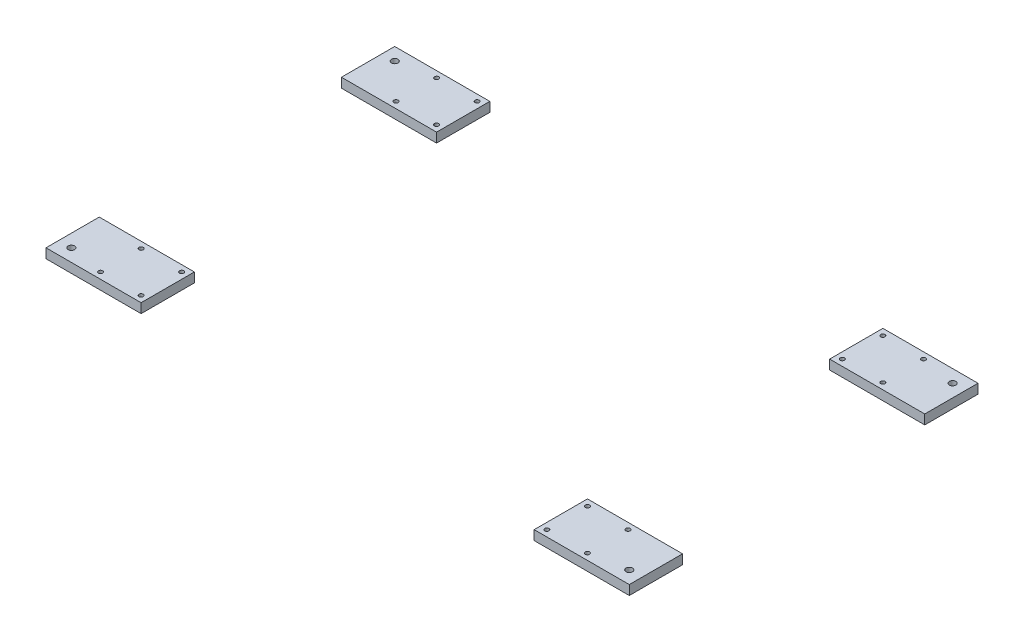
ISO-10303-21;
HEADER;
FILE_DESCRIPTION(('STEP AP214'),'2;1');
FILE_NAME('part.step','',(''),(''),'','','');
FILE_SCHEMA(('AUTOMOTIVE_DESIGN { 1 0 10303 214 1 1 1 1 }'));
ENDSEC;
DATA;
#1=APPLICATION_CONTEXT('core data for automotive mechanical design processes');
#2=APPLICATION_PROTOCOL_DEFINITION('international standard','automotive_design',2000,#1);
#3=PRODUCT_CONTEXT('',#1,'mechanical');
#4=PRODUCT('Part','Part','',(#3));
#5=PRODUCT_RELATED_PRODUCT_CATEGORY('part','',(#4));
#6=PRODUCT_DEFINITION_FORMATION('','',#4);
#7=PRODUCT_DEFINITION_CONTEXT('part definition',#1,'design');
#8=PRODUCT_DEFINITION('design','',#6,#7);
#9=PRODUCT_DEFINITION_SHAPE('','',#8);
#10=(LENGTH_UNIT() NAMED_UNIT(*) SI_UNIT(.MILLI.,.METRE.));
#11=(NAMED_UNIT(*) PLANE_ANGLE_UNIT() SI_UNIT($,.RADIAN.));
#12=(NAMED_UNIT(*) SI_UNIT($,.STERADIAN.) SOLID_ANGLE_UNIT());
#13=UNCERTAINTY_MEASURE_WITH_UNIT(LENGTH_MEASURE(1.E-05),#10,'distance_accuracy_value','');
#14=(GEOMETRIC_REPRESENTATION_CONTEXT(3) GLOBAL_UNCERTAINTY_ASSIGNED_CONTEXT((#13)) GLOBAL_UNIT_ASSIGNED_CONTEXT((#10,
#11,#12)) REPRESENTATION_CONTEXT('',''));
#15=CARTESIAN_POINT('',(0.,0.,0.));
#16=DIRECTION('',(0.,0.,1.));
#17=DIRECTION('',(1.,0.,0.));
#18=AXIS2_PLACEMENT_3D('',#15,#16,#17);
#19=CARTESIAN_POINT('',(770.,0.,550.));
#20=DIRECTION('',(1.,0.,0.));
#21=DIRECTION('',(0.,0.,-1.));
#22=AXIS2_PLACEMENT_3D('',#19,#20,#21);
#23=PLANE('',#22);
#24=DIRECTION('',(0.,1.,0.));
#25=VECTOR('',#24,1.);
#26=CARTESIAN_POINT('',(770.,-535.,466.));
#27=LINE('',#26,#25);
#28=CARTESIAN_POINT('',(770.,0.,466.));
#29=VERTEX_POINT('',#28);
#30=CARTESIAN_POINT('',(770.,15.,466.));
#31=VERTEX_POINT('',#30);
#32=EDGE_CURVE('E80',#29,#31,#27,.T.);
#33=ORIENTED_EDGE('',*,*,#32,.F.);
#34=DIRECTION('',(0.,0.,-1.));
#35=VECTOR('',#34,1.);
#36=CARTESIAN_POINT('',(770.,0.,550.));
#37=LINE('',#36,#35);
#38=CARTESIAN_POINT('',(770.,0.,550.));
#39=VERTEX_POINT('',#38);
#40=EDGE_CURVE('E123',#39,#29,#37,.T.);
#41=ORIENTED_EDGE('',*,*,#40,.F.);
#42=DIRECTION('',(0.,-1.,0.));
#43=VECTOR('',#42,1.);
#44=CARTESIAN_POINT('',(770.,0.,550.));
#45=LINE('',#44,#43);
#46=CARTESIAN_POINT('',(770.,15.,550.));
#47=VERTEX_POINT('',#46);
#48=EDGE_CURVE('E102',#47,#39,#45,.T.);
#49=ORIENTED_EDGE('',*,*,#48,.F.);
#50=DIRECTION('',(0.,0.,-1.));
#51=VECTOR('',#50,1.);
#52=CARTESIAN_POINT('',(770.,15.,550.));
#53=LINE('',#52,#51);
#54=EDGE_CURVE('E47',#47,#31,#53,.T.);
#55=ORIENTED_EDGE('',*,*,#54,.T.);
#56=EDGE_LOOP('',(#33,#41,#49,#55));
#57=FACE_BOUND('',#56,.T.);
#58=ADVANCED_FACE('F44',(#57),#23,.F.);
#59=CARTESIAN_POINT('',(770.,0.,550.));
#60=DIRECTION('',(0.,1.,0.));
#61=DIRECTION('',(0.,0.,1.));
#62=AXIS2_PLACEMENT_3D('',#59,#60,#61);
#63=PLANE('',#62);
#64=CARTESIAN_POINT('',(780.,0.,540.));
#65=DIRECTION('',(0.,1.,0.));
#66=DIRECTION('',(0.,0.,1.));
#67=AXIS2_PLACEMENT_3D('',#64,#65,#66);
#68=CIRCLE('',#67,3.37500000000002);
#69=CARTESIAN_POINT('',(780.,0.,543.375));
#70=VERTEX_POINT('',#69);
#71=EDGE_CURVE('E103',#70,#70,#68,.T.);
#72=ORIENTED_EDGE('',*,*,#71,.T.);
#73=EDGE_LOOP('',(#72));
#74=FACE_BOUND('',#73,.T.);
#75=CARTESIAN_POINT('',(780.,0.,476.));
#76=DIRECTION('',(0.,1.,0.));
#77=DIRECTION('',(0.,0.,1.));
#78=AXIS2_PLACEMENT_3D('',#75,#76,#77);
#79=CIRCLE('',#78,3.37500000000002);
#80=CARTESIAN_POINT('',(780.,0.,479.375000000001));
#81=VERTEX_POINT('',#80);
#82=EDGE_CURVE('E105',#81,#81,#79,.T.);
#83=ORIENTED_EDGE('',*,*,#82,.T.);
#84=EDGE_LOOP('',(#83));
#85=FACE_BOUND('',#84,.T.);
#86=CARTESIAN_POINT('',(843.999999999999,0.,476.));
#87=DIRECTION('',(0.,1.,0.));
#88=DIRECTION('',(0.,0.,1.));
#89=AXIS2_PLACEMENT_3D('',#86,#87,#88);
#90=CIRCLE('',#89,3.37500000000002);
#91=CARTESIAN_POINT('',(843.999999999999,0.,479.375000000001));
#92=VERTEX_POINT('',#91);
#93=EDGE_CURVE('E110',#92,#92,#90,.T.);
#94=ORIENTED_EDGE('',*,*,#93,.T.);
#95=EDGE_LOOP('',(#94));
#96=FACE_BOUND('',#95,.T.);
#97=CARTESIAN_POINT('',(843.999999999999,0.,540.));
#98=DIRECTION('',(0.,1.,0.));
#99=DIRECTION('',(0.,0.,1.));
#100=AXIS2_PLACEMENT_3D('',#97,#98,#99);
#101=CIRCLE('',#100,3.37500000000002);
#102=CARTESIAN_POINT('',(843.999999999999,0.,543.375));
#103=VERTEX_POINT('',#102);
#104=EDGE_CURVE('E117',#103,#103,#101,.T.);
#105=ORIENTED_EDGE('',*,*,#104,.T.);
#106=EDGE_LOOP('',(#105));
#107=FACE_BOUND('',#106,.T.);
#108=CARTESIAN_POINT('',(900.,0.,530.));
#109=DIRECTION('',(0.,1.,0.));
#110=DIRECTION('',(0.,0.,1.));
#111=AXIS2_PLACEMENT_3D('',#108,#109,#110);
#112=CIRCLE('',#111,5.12500000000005);
#113=CARTESIAN_POINT('',(900.,0.,535.125));
#114=VERTEX_POINT('',#113);
#115=EDGE_CURVE('E120',#114,#114,#112,.T.);
#116=ORIENTED_EDGE('',*,*,#115,.T.);
#117=EDGE_LOOP('',(#116));
#118=FACE_BOUND('',#117,.T.);
#119=DIRECTION('',(-1.,0.,0.));
#120=VECTOR('',#119,1.);
#121=CARTESIAN_POINT('',(770.,0.,466.));
#122=LINE('',#121,#120);
#123=CARTESIAN_POINT('',(919.999999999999,0.,466.));
#124=VERTEX_POINT('',#123);
#125=EDGE_CURVE('E84',#124,#29,#122,.T.);
#126=ORIENTED_EDGE('',*,*,#125,.F.);
#127=DIRECTION('',(0.,0.,-1.));
#128=VECTOR('',#127,1.);
#129=CARTESIAN_POINT('',(920.,0.,550.));
#130=LINE('',#129,#128);
#131=CARTESIAN_POINT('',(920.,0.,550.));
#132=VERTEX_POINT('',#131);
#133=EDGE_CURVE('E99',#132,#124,#130,.T.);
#134=ORIENTED_EDGE('',*,*,#133,.F.);
#135=DIRECTION('',(1.,0.,0.));
#136=VECTOR('',#135,1.);
#137=CARTESIAN_POINT('',(770.,0.,550.));
#138=LINE('',#137,#136);
#139=EDGE_CURVE('E139',#39,#132,#138,.T.);
#140=ORIENTED_EDGE('',*,*,#139,.F.);
#141=ORIENTED_EDGE('',*,*,#40,.T.);
#142=EDGE_LOOP('',(#126,#134,#140,#141));
#143=FACE_BOUND('',#142,.T.);
#144=ADVANCED_FACE('F150',(#74,#85,#96,#107,#118,#143),#63,.F.);
#145=CARTESIAN_POINT('',(920.,0.,550.));
#146=DIRECTION('',(-1.,0.,0.));
#147=DIRECTION('',(0.,0.,1.));
#148=AXIS2_PLACEMENT_3D('',#145,#146,#147);
#149=PLANE('',#148);
#150=DIRECTION('',(0.,1.,0.));
#151=VECTOR('',#150,1.);
#152=CARTESIAN_POINT('',(919.999999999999,-535.,466.));
#153=LINE('',#152,#151);
#154=CARTESIAN_POINT('',(919.999999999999,15.,466.));
#155=VERTEX_POINT('',#154);
#156=EDGE_CURVE('E60',#124,#155,#153,.T.);
#157=ORIENTED_EDGE('',*,*,#156,.T.);
#158=DIRECTION('',(0.,0.,-1.));
#159=VECTOR('',#158,1.);
#160=CARTESIAN_POINT('',(920.,15.,550.));
#161=LINE('',#160,#159);
#162=CARTESIAN_POINT('',(920.,15.,550.));
#163=VERTEX_POINT('',#162);
#164=EDGE_CURVE('E98',#163,#155,#161,.T.);
#165=ORIENTED_EDGE('',*,*,#164,.F.);
#166=DIRECTION('',(0.,1.,0.));
#167=VECTOR('',#166,1.);
#168=CARTESIAN_POINT('',(920.,0.,550.));
#169=LINE('',#168,#167);
#170=EDGE_CURVE('E141',#132,#163,#169,.T.);
#171=ORIENTED_EDGE('',*,*,#170,.F.);
#172=ORIENTED_EDGE('',*,*,#133,.T.);
#173=EDGE_LOOP('',(#157,#165,#171,#172));
#174=FACE_BOUND('',#173,.T.);
#175=ADVANCED_FACE('F148',(#174),#149,.F.);
#176=CARTESIAN_POINT('',(770.,15.,550.));
#177=DIRECTION('',(0.,-1.,0.));
#178=DIRECTION('',(0.,0.,-1.));
#179=AXIS2_PLACEMENT_3D('',#176,#177,#178);
#180=PLANE('',#179);
#181=CARTESIAN_POINT('',(780.,15.,540.));
#182=DIRECTION('',(0.,1.,0.));
#183=DIRECTION('',(0.,0.,1.));
#184=AXIS2_PLACEMENT_3D('',#181,#182,#183);
#185=CIRCLE('',#184,3.37500000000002);
#186=CARTESIAN_POINT('',(780.,15.,543.375));
#187=VERTEX_POINT('',#186);
#188=EDGE_CURVE('E13',#187,#187,#185,.T.);
#189=ORIENTED_EDGE('',*,*,#188,.F.);
#190=EDGE_LOOP('',(#189));
#191=FACE_BOUND('',#190,.T.);
#192=CARTESIAN_POINT('',(780.,15.,476.));
#193=DIRECTION('',(0.,1.,0.));
#194=DIRECTION('',(0.,0.,1.));
#195=AXIS2_PLACEMENT_3D('',#192,#193,#194);
#196=CIRCLE('',#195,3.37500000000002);
#197=CARTESIAN_POINT('',(780.,15.,479.375000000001));
#198=VERTEX_POINT('',#197);
#199=EDGE_CURVE('E53',#198,#198,#196,.T.);
#200=ORIENTED_EDGE('',*,*,#199,.F.);
#201=EDGE_LOOP('',(#200));
#202=FACE_BOUND('',#201,.T.);
#203=CARTESIAN_POINT('',(843.999999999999,15.,476.));
#204=DIRECTION('',(0.,1.,0.));
#205=DIRECTION('',(0.,0.,1.));
#206=AXIS2_PLACEMENT_3D('',#203,#204,#205);
#207=CIRCLE('',#206,3.37500000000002);
#208=CARTESIAN_POINT('',(843.999999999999,15.,479.375000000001));
#209=VERTEX_POINT('',#208);
#210=EDGE_CURVE('E132',#209,#209,#207,.T.);
#211=ORIENTED_EDGE('',*,*,#210,.F.);
#212=EDGE_LOOP('',(#211));
#213=FACE_BOUND('',#212,.T.);
#214=CARTESIAN_POINT('',(843.999999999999,15.,540.));
#215=DIRECTION('',(0.,1.,0.));
#216=DIRECTION('',(0.,0.,1.));
#217=AXIS2_PLACEMENT_3D('',#214,#215,#216);
#218=CIRCLE('',#217,3.37500000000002);
#219=CARTESIAN_POINT('',(843.999999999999,15.,543.375));
#220=VERTEX_POINT('',#219);
#221=EDGE_CURVE('E129',#220,#220,#218,.T.);
#222=ORIENTED_EDGE('',*,*,#221,.F.);
#223=EDGE_LOOP('',(#222));
#224=FACE_BOUND('',#223,.T.);
#225=CARTESIAN_POINT('',(900.,15.,530.));
#226=DIRECTION('',(0.,1.,0.));
#227=DIRECTION('',(0.,0.,1.));
#228=AXIS2_PLACEMENT_3D('',#225,#226,#227);
#229=CIRCLE('',#228,5.12500000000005);
#230=CARTESIAN_POINT('',(900.,15.,535.125));
#231=VERTEX_POINT('',#230);
#232=EDGE_CURVE('E89',#231,#231,#229,.T.);
#233=ORIENTED_EDGE('',*,*,#232,.F.);
#234=EDGE_LOOP('',(#233));
#235=FACE_BOUND('',#234,.T.);
#236=DIRECTION('',(-1.,0.,0.));
#237=VECTOR('',#236,1.);
#238=CARTESIAN_POINT('',(770.,15.,466.));
#239=LINE('',#238,#237);
#240=EDGE_CURVE('E83',#155,#31,#239,.T.);
#241=ORIENTED_EDGE('',*,*,#240,.T.);
#242=ORIENTED_EDGE('',*,*,#54,.F.);
#243=DIRECTION('',(-1.,0.,0.));
#244=VECTOR('',#243,1.);
#245=CARTESIAN_POINT('',(770.,15.,550.));
#246=LINE('',#245,#244);
#247=EDGE_CURVE('E125',#163,#47,#246,.T.);
#248=ORIENTED_EDGE('',*,*,#247,.F.);
#249=ORIENTED_EDGE('',*,*,#164,.T.);
#250=EDGE_LOOP('',(#241,#242,#248,#249));
#251=FACE_BOUND('',#250,.T.);
#252=ADVANCED_FACE('F94',(#191,#202,#213,#224,#235,#251),#180,.F.);
#253=CARTESIAN_POINT('',(770.,15.,550.));
#254=DIRECTION('',(0.,0.,-1.));
#255=DIRECTION('',(-1.,0.,0.));
#256=AXIS2_PLACEMENT_3D('',#253,#254,#255);
#257=PLANE('',#256);
#258=ORIENTED_EDGE('',*,*,#48,.T.);
#259=ORIENTED_EDGE('',*,*,#139,.T.);
#260=ORIENTED_EDGE('',*,*,#170,.T.);
#261=ORIENTED_EDGE('',*,*,#247,.T.);
#262=EDGE_LOOP('',(#258,#259,#260,#261));
#263=FACE_BOUND('',#262,.T.);
#264=ADVANCED_FACE('F145',(#263),#257,.F.);
#265=CARTESIAN_POINT('',(770.,-535.,466.));
#266=DIRECTION('',(0.,0.,-1.));
#267=DIRECTION('',(-1.,0.,0.));
#268=AXIS2_PLACEMENT_3D('',#265,#266,#267);
#269=PLANE('',#268);
#270=ORIENTED_EDGE('',*,*,#125,.T.);
#271=ORIENTED_EDGE('',*,*,#32,.T.);
#272=ORIENTED_EDGE('',*,*,#240,.F.);
#273=ORIENTED_EDGE('',*,*,#156,.F.);
#274=EDGE_LOOP('',(#270,#271,#272,#273));
#275=FACE_BOUND('',#274,.T.);
#276=ADVANCED_FACE('F82',(#275),#269,.T.);
#277=CARTESIAN_POINT('',(900.,-535.,530.));
#278=DIRECTION('',(0.,1.,0.));
#279=DIRECTION('',(0.,0.,1.));
#280=AXIS2_PLACEMENT_3D('',#277,#278,#279);
#281=CYLINDRICAL_SURFACE('',#280,5.12500000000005);
#282=ORIENTED_EDGE('',*,*,#232,.T.);
#283=EDGE_LOOP('',(#282));
#284=FACE_BOUND('',#283,.T.);
#285=ORIENTED_EDGE('',*,*,#115,.F.);
#286=EDGE_LOOP('',(#285));
#287=FACE_BOUND('',#286,.T.);
#288=ADVANCED_FACE('F177',(#284,#287),#281,.F.);
#289=CARTESIAN_POINT('',(843.999999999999,-535.,540.));
#290=DIRECTION('',(0.,1.,0.));
#291=DIRECTION('',(0.,0.,1.));
#292=AXIS2_PLACEMENT_3D('',#289,#290,#291);
#293=CYLINDRICAL_SURFACE('',#292,3.37500000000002);
#294=ORIENTED_EDGE('',*,*,#221,.T.);
#295=EDGE_LOOP('',(#294));
#296=FACE_BOUND('',#295,.T.);
#297=ORIENTED_EDGE('',*,*,#104,.F.);
#298=EDGE_LOOP('',(#297));
#299=FACE_BOUND('',#298,.T.);
#300=ADVANCED_FACE('F173',(#296,#299),#293,.F.);
#301=CARTESIAN_POINT('',(843.999999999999,-535.,476.));
#302=DIRECTION('',(0.,1.,0.));
#303=DIRECTION('',(0.,0.,1.));
#304=AXIS2_PLACEMENT_3D('',#301,#302,#303);
#305=CYLINDRICAL_SURFACE('',#304,3.37500000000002);
#306=ORIENTED_EDGE('',*,*,#210,.T.);
#307=EDGE_LOOP('',(#306));
#308=FACE_BOUND('',#307,.T.);
#309=ORIENTED_EDGE('',*,*,#93,.F.);
#310=EDGE_LOOP('',(#309));
#311=FACE_BOUND('',#310,.T.);
#312=ADVANCED_FACE('F169',(#308,#311),#305,.F.);
#313=CARTESIAN_POINT('',(780.,-535.,476.));
#314=DIRECTION('',(0.,1.,0.));
#315=DIRECTION('',(0.,0.,1.));
#316=AXIS2_PLACEMENT_3D('',#313,#314,#315);
#317=CYLINDRICAL_SURFACE('',#316,3.37500000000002);
#318=ORIENTED_EDGE('',*,*,#199,.T.);
#319=EDGE_LOOP('',(#318));
#320=FACE_BOUND('',#319,.T.);
#321=ORIENTED_EDGE('',*,*,#82,.F.);
#322=EDGE_LOOP('',(#321));
#323=FACE_BOUND('',#322,.T.);
#324=ADVANCED_FACE('F165',(#320,#323),#317,.F.);
#325=CARTESIAN_POINT('',(780.,-535.,540.));
#326=DIRECTION('',(0.,1.,0.));
#327=DIRECTION('',(0.,0.,1.));
#328=AXIS2_PLACEMENT_3D('',#325,#326,#327);
#329=CYLINDRICAL_SURFACE('',#328,3.37500000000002);
#330=ORIENTED_EDGE('',*,*,#188,.T.);
#331=EDGE_LOOP('',(#330));
#332=FACE_BOUND('',#331,.T.);
#333=ORIENTED_EDGE('',*,*,#71,.F.);
#334=EDGE_LOOP('',(#333));
#335=FACE_BOUND('',#334,.T.);
#336=ADVANCED_FACE('F162',(#332,#335),#329,.F.);
#337=CLOSED_SHELL('',(#58,#144,#175,#252,#264,#276,#288,#300,#312,#324,#336));
#338=MANIFOLD_SOLID_BREP('B2',#337);
#339=CARTESIAN_POINT('',(150.,0.,550.));
#340=DIRECTION('',(-1.,0.,0.));
#341=DIRECTION('',(0.,0.,1.));
#342=AXIS2_PLACEMENT_3D('',#339,#340,#341);
#343=PLANE('',#342);
#344=DIRECTION('',(0.,1.,0.));
#345=VECTOR('',#344,1.);
#346=CARTESIAN_POINT('',(150.,-535.,466.));
#347=LINE('',#346,#345);
#348=CARTESIAN_POINT('',(150.,0.,466.));
#349=VERTEX_POINT('',#348);
#350=CARTESIAN_POINT('',(150.,15.,466.));
#351=VERTEX_POINT('',#350);
#352=EDGE_CURVE('E299',#349,#351,#347,.T.);
#353=ORIENTED_EDGE('',*,*,#352,.T.);
#354=DIRECTION('',(0.,0.,-1.));
#355=VECTOR('',#354,1.);
#356=CARTESIAN_POINT('',(150.,15.,550.));
#357=LINE('',#356,#355);
#358=CARTESIAN_POINT('',(150.,15.,550.));
#359=VERTEX_POINT('',#358);
#360=EDGE_CURVE('E336',#359,#351,#357,.T.);
#361=ORIENTED_EDGE('',*,*,#360,.F.);
#362=DIRECTION('',(0.,1.,0.));
#363=VECTOR('',#362,1.);
#364=CARTESIAN_POINT('',(150.,0.,550.));
#365=LINE('',#364,#363);
#366=CARTESIAN_POINT('',(150.,0.,550.));
#367=VERTEX_POINT('',#366);
#368=EDGE_CURVE('E347',#367,#359,#365,.T.);
#369=ORIENTED_EDGE('',*,*,#368,.F.);
#370=DIRECTION('',(0.,0.,-1.));
#371=VECTOR('',#370,1.);
#372=CARTESIAN_POINT('',(150.,0.,550.));
#373=LINE('',#372,#371);
#374=EDGE_CURVE('E285',#367,#349,#373,.T.);
#375=ORIENTED_EDGE('',*,*,#374,.T.);
#376=EDGE_LOOP('',(#353,#361,#369,#375));
#377=FACE_BOUND('',#376,.T.);
#378=ADVANCED_FACE('F282',(#377),#343,.F.);
#379=CARTESIAN_POINT('',(150.,15.,550.));
#380=DIRECTION('',(0.,-1.,0.));
#381=DIRECTION('',(0.,0.,-1.));
#382=AXIS2_PLACEMENT_3D('',#379,#380,#381);
#383=PLANE('',#382);
#384=CARTESIAN_POINT('',(140.,15.,540.));
#385=DIRECTION('',(0.,1.,0.));
#386=DIRECTION('',(0.,0.,1.));
#387=AXIS2_PLACEMENT_3D('',#384,#385,#386);
#388=CIRCLE('',#387,3.37499999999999);
#389=CARTESIAN_POINT('',(140.,15.,543.375));
#390=VERTEX_POINT('',#389);
#391=EDGE_CURVE('E42',#390,#390,#388,.T.);
#392=ORIENTED_EDGE('',*,*,#391,.F.);
#393=EDGE_LOOP('',(#392));
#394=FACE_BOUND('',#393,.T.);
#395=CARTESIAN_POINT('',(140.,15.,476.));
#396=DIRECTION('',(0.,1.,0.));
#397=DIRECTION('',(0.,0.,1.));
#398=AXIS2_PLACEMENT_3D('',#395,#396,#397);
#399=CIRCLE('',#398,3.37499999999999);
#400=CARTESIAN_POINT('',(140.,15.,479.375));
#401=VERTEX_POINT('',#400);
#402=EDGE_CURVE('E291',#401,#401,#399,.T.);
#403=ORIENTED_EDGE('',*,*,#402,.F.);
#404=EDGE_LOOP('',(#403));
#405=FACE_BOUND('',#404,.T.);
#406=CARTESIAN_POINT('',(76.,15.,476.));
#407=DIRECTION('',(0.,1.,0.));
#408=DIRECTION('',(0.,0.,1.));
#409=AXIS2_PLACEMENT_3D('',#406,#407,#408);
#410=CIRCLE('',#409,3.375);
#411=CARTESIAN_POINT('',(76.,15.,479.375000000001));
#412=VERTEX_POINT('',#411);
#413=EDGE_CURVE('E375',#412,#412,#410,.T.);
#414=ORIENTED_EDGE('',*,*,#413,.F.);
#415=EDGE_LOOP('',(#414));
#416=FACE_BOUND('',#415,.T.);
#417=CARTESIAN_POINT('',(76.,15.,540.));
#418=DIRECTION('',(0.,1.,0.));
#419=DIRECTION('',(0.,0.,1.));
#420=AXIS2_PLACEMENT_3D('',#417,#418,#419);
#421=CIRCLE('',#420,3.375);
#422=CARTESIAN_POINT('',(76.,15.,543.375));
#423=VERTEX_POINT('',#422);
#424=EDGE_CURVE('E372',#423,#423,#421,.T.);
#425=ORIENTED_EDGE('',*,*,#424,.F.);
#426=EDGE_LOOP('',(#425));
#427=FACE_BOUND('',#426,.T.);
#428=CARTESIAN_POINT('',(20.,15.,530.));
#429=DIRECTION('',(0.,1.,0.));
#430=DIRECTION('',(0.,0.,1.));
#431=AXIS2_PLACEMENT_3D('',#428,#429,#430);
#432=CIRCLE('',#431,5.125);
#433=CARTESIAN_POINT('',(20.,15.,535.125));
#434=VERTEX_POINT('',#433);
#435=EDGE_CURVE('E327',#434,#434,#432,.T.);
#436=ORIENTED_EDGE('',*,*,#435,.F.);
#437=EDGE_LOOP('',(#436));
#438=FACE_BOUND('',#437,.T.);
#439=DIRECTION('',(-1.,0.,0.));
#440=VECTOR('',#439,1.);
#441=CARTESIAN_POINT('',(150.,15.,466.));
#442=LINE('',#441,#440);
#443=CARTESIAN_POINT('',(0.,15.,466.));
#444=VERTEX_POINT('',#443);
#445=EDGE_CURVE('E321',#351,#444,#442,.T.);
#446=ORIENTED_EDGE('',*,*,#445,.T.);
#447=DIRECTION('',(0.,0.,-1.));
#448=VECTOR('',#447,1.);
#449=CARTESIAN_POINT('',(0.,15.,550.));
#450=LINE('',#449,#448);
#451=CARTESIAN_POINT('',(0.,15.,550.));
#452=VERTEX_POINT('',#451);
#453=EDGE_CURVE('E333',#452,#444,#450,.T.);
#454=ORIENTED_EDGE('',*,*,#453,.F.);
#455=DIRECTION('',(-1.,0.,0.));
#456=VECTOR('',#455,1.);
#457=CARTESIAN_POINT('',(150.,15.,550.));
#458=LINE('',#457,#456);
#459=EDGE_CURVE('E352',#359,#452,#458,.T.);
#460=ORIENTED_EDGE('',*,*,#459,.F.);
#461=ORIENTED_EDGE('',*,*,#360,.T.);
#462=EDGE_LOOP('',(#446,#454,#460,#461));
#463=FACE_BOUND('',#462,.T.);
#464=ADVANCED_FACE('F332',(#394,#405,#416,#427,#438,#463),#383,.F.);
#465=CARTESIAN_POINT('',(0.,0.,550.));
#466=DIRECTION('',(1.,0.,0.));
#467=DIRECTION('',(0.,0.,-1.));
#468=AXIS2_PLACEMENT_3D('',#465,#466,#467);
#469=PLANE('',#468);
#470=DIRECTION('',(0.,1.,0.));
#471=VECTOR('',#470,1.);
#472=CARTESIAN_POINT('',(0.,-535.,466.));
#473=LINE('',#472,#471);
#474=CARTESIAN_POINT('',(0.,0.,466.));
#475=VERTEX_POINT('',#474);
#476=EDGE_CURVE('E318',#475,#444,#473,.T.);
#477=ORIENTED_EDGE('',*,*,#476,.F.);
#478=DIRECTION('',(0.,0.,-1.));
#479=VECTOR('',#478,1.);
#480=CARTESIAN_POINT('',(0.,0.,550.));
#481=LINE('',#480,#479);
#482=CARTESIAN_POINT('',(0.,0.,550.));
#483=VERTEX_POINT('',#482);
#484=EDGE_CURVE('E346',#483,#475,#481,.T.);
#485=ORIENTED_EDGE('',*,*,#484,.F.);
#486=DIRECTION('',(0.,-1.,0.));
#487=VECTOR('',#486,1.);
#488=CARTESIAN_POINT('',(0.,0.,550.));
#489=LINE('',#488,#487);
#490=EDGE_CURVE('E339',#452,#483,#489,.T.);
#491=ORIENTED_EDGE('',*,*,#490,.F.);
#492=ORIENTED_EDGE('',*,*,#453,.T.);
#493=EDGE_LOOP('',(#477,#485,#491,#492));
#494=FACE_BOUND('',#493,.T.);
#495=ADVANCED_FACE('F338',(#494),#469,.F.);
#496=CARTESIAN_POINT('',(150.,0.,550.));
#497=DIRECTION('',(0.,1.,0.));
#498=DIRECTION('',(0.,0.,1.));
#499=AXIS2_PLACEMENT_3D('',#496,#497,#498);
#500=PLANE('',#499);
#501=CARTESIAN_POINT('',(140.,0.,540.));
#502=DIRECTION('',(0.,1.,0.));
#503=DIRECTION('',(0.,0.,1.));
#504=AXIS2_PLACEMENT_3D('',#501,#502,#503);
#505=CIRCLE('',#504,3.37499999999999);
#506=CARTESIAN_POINT('',(140.,0.,543.375));
#507=VERTEX_POINT('',#506);
#508=EDGE_CURVE('E340',#507,#507,#505,.T.);
#509=ORIENTED_EDGE('',*,*,#508,.T.);
#510=EDGE_LOOP('',(#509));
#511=FACE_BOUND('',#510,.T.);
#512=CARTESIAN_POINT('',(140.,0.,476.));
#513=DIRECTION('',(0.,1.,0.));
#514=DIRECTION('',(0.,0.,1.));
#515=AXIS2_PLACEMENT_3D('',#512,#513,#514);
#516=CIRCLE('',#515,3.37499999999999);
#517=CARTESIAN_POINT('',(140.,0.,479.375));
#518=VERTEX_POINT('',#517);
#519=EDGE_CURVE('E343',#518,#518,#516,.T.);
#520=ORIENTED_EDGE('',*,*,#519,.T.);
#521=EDGE_LOOP('',(#520));
#522=FACE_BOUND('',#521,.T.);
#523=CARTESIAN_POINT('',(76.,0.,476.));
#524=DIRECTION('',(0.,1.,0.));
#525=DIRECTION('',(0.,0.,1.));
#526=AXIS2_PLACEMENT_3D('',#523,#524,#525);
#527=CIRCLE('',#526,3.375);
#528=CARTESIAN_POINT('',(76.,0.,479.375000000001));
#529=VERTEX_POINT('',#528);
#530=EDGE_CURVE('E360',#529,#529,#527,.T.);
#531=ORIENTED_EDGE('',*,*,#530,.T.);
#532=EDGE_LOOP('',(#531));
#533=FACE_BOUND('',#532,.T.);
#534=CARTESIAN_POINT('',(76.,0.,540.));
#535=DIRECTION('',(0.,1.,0.));
#536=DIRECTION('',(0.,0.,1.));
#537=AXIS2_PLACEMENT_3D('',#534,#535,#536);
#538=CIRCLE('',#537,3.375);
#539=CARTESIAN_POINT('',(76.,0.,543.375));
#540=VERTEX_POINT('',#539);
#541=EDGE_CURVE('E355',#540,#540,#538,.T.);
#542=ORIENTED_EDGE('',*,*,#541,.T.);
#543=EDGE_LOOP('',(#542));
#544=FACE_BOUND('',#543,.T.);
#545=CARTESIAN_POINT('',(20.,0.,530.));
#546=DIRECTION('',(0.,1.,0.));
#547=DIRECTION('',(0.,0.,1.));
#548=AXIS2_PLACEMENT_3D('',#545,#546,#547);
#549=CIRCLE('',#548,5.125);
#550=CARTESIAN_POINT('',(20.,0.,535.125));
#551=VERTEX_POINT('',#550);
#552=EDGE_CURVE('E348',#551,#551,#549,.T.);
#553=ORIENTED_EDGE('',*,*,#552,.T.);
#554=EDGE_LOOP('',(#553));
#555=FACE_BOUND('',#554,.T.);
#556=DIRECTION('',(-1.,0.,0.));
#557=VECTOR('',#556,1.);
#558=CARTESIAN_POINT('',(150.,0.,466.));
#559=LINE('',#558,#557);
#560=EDGE_CURVE('E322',#349,#475,#559,.T.);
#561=ORIENTED_EDGE('',*,*,#560,.F.);
#562=ORIENTED_EDGE('',*,*,#374,.F.);
#563=DIRECTION('',(1.,0.,0.));
#564=VECTOR('',#563,1.);
#565=CARTESIAN_POINT('',(150.,0.,550.));
#566=LINE('',#565,#564);
#567=EDGE_CURVE('E365',#483,#367,#566,.T.);
#568=ORIENTED_EDGE('',*,*,#567,.F.);
#569=ORIENTED_EDGE('',*,*,#484,.T.);
#570=EDGE_LOOP('',(#561,#562,#568,#569));
#571=FACE_BOUND('',#570,.T.);
#572=ADVANCED_FACE('F414',(#511,#522,#533,#544,#555,#571),#500,.F.);
#573=CARTESIAN_POINT('',(150.,15.,550.));
#574=DIRECTION('',(0.,0.,1.));
#575=DIRECTION('',(1.,0.,0.));
#576=AXIS2_PLACEMENT_3D('',#573,#574,#575);
#577=PLANE('',#576);
#578=ORIENTED_EDGE('',*,*,#368,.T.);
#579=ORIENTED_EDGE('',*,*,#459,.T.);
#580=ORIENTED_EDGE('',*,*,#490,.T.);
#581=ORIENTED_EDGE('',*,*,#567,.T.);
#582=EDGE_LOOP('',(#578,#579,#580,#581));
#583=FACE_BOUND('',#582,.T.);
#584=ADVANCED_FACE('F405',(#583),#577,.T.);
#585=CARTESIAN_POINT('',(150.,-535.,466.));
#586=DIRECTION('',(0.,0.,-1.));
#587=DIRECTION('',(-1.,0.,0.));
#588=AXIS2_PLACEMENT_3D('',#585,#586,#587);
#589=PLANE('',#588);
#590=ORIENTED_EDGE('',*,*,#560,.T.);
#591=ORIENTED_EDGE('',*,*,#476,.T.);
#592=ORIENTED_EDGE('',*,*,#445,.F.);
#593=ORIENTED_EDGE('',*,*,#352,.F.);
#594=EDGE_LOOP('',(#590,#591,#592,#593));
#595=FACE_BOUND('',#594,.T.);
#596=ADVANCED_FACE('F320',(#595),#589,.T.);
#597=CARTESIAN_POINT('',(20.,-535.,530.));
#598=DIRECTION('',(0.,1.,0.));
#599=DIRECTION('',(0.,0.,1.));
#600=AXIS2_PLACEMENT_3D('',#597,#598,#599);
#601=CYLINDRICAL_SURFACE('',#600,5.125);
#602=ORIENTED_EDGE('',*,*,#435,.T.);
#603=EDGE_LOOP('',(#602));
#604=FACE_BOUND('',#603,.T.);
#605=ORIENTED_EDGE('',*,*,#552,.F.);
#606=EDGE_LOOP('',(#605));
#607=FACE_BOUND('',#606,.T.);
#608=ADVANCED_FACE('F393',(#604,#607),#601,.F.);
#609=CARTESIAN_POINT('',(76.,-535.,540.));
#610=DIRECTION('',(0.,1.,0.));
#611=DIRECTION('',(0.,0.,1.));
#612=AXIS2_PLACEMENT_3D('',#609,#610,#611);
#613=CYLINDRICAL_SURFACE('',#612,3.375);
#614=ORIENTED_EDGE('',*,*,#424,.T.);
#615=EDGE_LOOP('',(#614));
#616=FACE_BOUND('',#615,.T.);
#617=ORIENTED_EDGE('',*,*,#541,.F.);
#618=EDGE_LOOP('',(#617));
#619=FACE_BOUND('',#618,.T.);
#620=ADVANCED_FACE('F396',(#616,#619),#613,.F.);
#621=CARTESIAN_POINT('',(76.,-535.,476.));
#622=DIRECTION('',(0.,1.,0.));
#623=DIRECTION('',(0.,0.,1.));
#624=AXIS2_PLACEMENT_3D('',#621,#622,#623);
#625=CYLINDRICAL_SURFACE('',#624,3.375);
#626=ORIENTED_EDGE('',*,*,#413,.T.);
#627=EDGE_LOOP('',(#626));
#628=FACE_BOUND('',#627,.T.);
#629=ORIENTED_EDGE('',*,*,#530,.F.);
#630=EDGE_LOOP('',(#629));
#631=FACE_BOUND('',#630,.T.);
#632=ADVANCED_FACE('F402',(#628,#631),#625,.F.);
#633=CARTESIAN_POINT('',(140.,-535.,476.));
#634=DIRECTION('',(0.,1.,0.));
#635=DIRECTION('',(0.,0.,1.));
#636=AXIS2_PLACEMENT_3D('',#633,#634,#635);
#637=CYLINDRICAL_SURFACE('',#636,3.37499999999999);
#638=ORIENTED_EDGE('',*,*,#402,.T.);
#639=EDGE_LOOP('',(#638));
#640=FACE_BOUND('',#639,.T.);
#641=ORIENTED_EDGE('',*,*,#519,.F.);
#642=EDGE_LOOP('',(#641));
#643=FACE_BOUND('',#642,.T.);
#644=ADVANCED_FACE('F381',(#640,#643),#637,.F.);
#645=CARTESIAN_POINT('',(140.,-535.,540.));
#646=DIRECTION('',(0.,1.,0.));
#647=DIRECTION('',(0.,0.,1.));
#648=AXIS2_PLACEMENT_3D('',#645,#646,#647);
#649=CYLINDRICAL_SURFACE('',#648,3.37499999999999);
#650=ORIENTED_EDGE('',*,*,#391,.T.);
#651=EDGE_LOOP('',(#650));
#652=FACE_BOUND('',#651,.T.);
#653=ORIENTED_EDGE('',*,*,#508,.F.);
#654=EDGE_LOOP('',(#653));
#655=FACE_BOUND('',#654,.T.);
#656=ADVANCED_FACE('F429',(#652,#655),#649,.F.);
#657=CLOSED_SHELL('',(#378,#464,#495,#572,#584,#596,#608,#620,#632,#644,#656));
#658=MANIFOLD_SOLID_BREP('B7',#657);
#659=CARTESIAN_POINT('',(770.,15.,0.));
#660=DIRECTION('',(0.,0.,-1.));
#661=DIRECTION('',(-1.,0.,0.));
#662=AXIS2_PLACEMENT_3D('',#659,#660,#661);
#663=PLANE('',#662);
#664=DIRECTION('',(0.,-1.,0.));
#665=VECTOR('',#664,1.);
#666=CARTESIAN_POINT('',(770.,0.,0.));
#667=LINE('',#666,#665);
#668=CARTESIAN_POINT('',(770.,15.,0.));
#669=VERTEX_POINT('',#668);
#670=CARTESIAN_POINT('',(770.,0.,0.));
#671=VERTEX_POINT('',#670);
#672=EDGE_CURVE('E588',#669,#671,#667,.T.);
#673=ORIENTED_EDGE('',*,*,#672,.F.);
#674=DIRECTION('',(-1.,0.,0.));
#675=VECTOR('',#674,1.);
#676=CARTESIAN_POINT('',(770.,15.,0.));
#677=LINE('',#676,#675);
#678=CARTESIAN_POINT('',(920.,15.,0.));
#679=VERTEX_POINT('',#678);
#680=EDGE_CURVE('E569',#679,#669,#677,.T.);
#681=ORIENTED_EDGE('',*,*,#680,.F.);
#682=DIRECTION('',(0.,1.,0.));
#683=VECTOR('',#682,1.);
#684=CARTESIAN_POINT('',(920.,0.,0.));
#685=LINE('',#684,#683);
#686=CARTESIAN_POINT('',(920.,0.,0.));
#687=VERTEX_POINT('',#686);
#688=EDGE_CURVE('E574',#687,#679,#685,.T.);
#689=ORIENTED_EDGE('',*,*,#688,.F.);
#690=DIRECTION('',(1.,0.,0.));
#691=VECTOR('',#690,1.);
#692=CARTESIAN_POINT('',(770.,0.,0.));
#693=LINE('',#692,#691);
#694=EDGE_CURVE('E585',#671,#687,#693,.T.);
#695=ORIENTED_EDGE('',*,*,#694,.F.);
#696=EDGE_LOOP('',(#673,#681,#689,#695));
#697=FACE_BOUND('',#696,.T.);
#698=ADVANCED_FACE('F519',(#697),#663,.T.);
#699=CARTESIAN_POINT('',(770.,15.,550.));
#700=DIRECTION('',(0.,-1.,0.));
#701=DIRECTION('',(0.,0.,-1.));
#702=AXIS2_PLACEMENT_3D('',#699,#700,#701);
#703=PLANE('',#702);
#704=CARTESIAN_POINT('',(780.,15.,9.99999999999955));
#705=DIRECTION('',(0.,1.,0.));
#706=DIRECTION('',(0.,0.,1.));
#707=AXIS2_PLACEMENT_3D('',#704,#705,#706);
#708=CIRCLE('',#707,3.37500000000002);
#709=CARTESIAN_POINT('',(780.,15.,13.3749999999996));
#710=VERTEX_POINT('',#709);
#711=EDGE_CURVE('E608',#710,#710,#708,.T.);
#712=ORIENTED_EDGE('',*,*,#711,.F.);
#713=EDGE_LOOP('',(#712));
#714=FACE_BOUND('',#713,.T.);
#715=CARTESIAN_POINT('',(780.,15.,73.9999999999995));
#716=DIRECTION('',(0.,1.,0.));
#717=DIRECTION('',(0.,0.,1.));
#718=AXIS2_PLACEMENT_3D('',#715,#716,#717);
#719=CIRCLE('',#718,3.37500000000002);
#720=CARTESIAN_POINT('',(780.,15.,77.3749999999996));
#721=VERTEX_POINT('',#720);
#722=EDGE_CURVE('E620',#721,#721,#719,.T.);
#723=ORIENTED_EDGE('',*,*,#722,.F.);
#724=EDGE_LOOP('',(#723));
#725=FACE_BOUND('',#724,.T.);
#726=CARTESIAN_POINT('',(843.999999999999,15.,73.9999999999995));
#727=DIRECTION('',(0.,1.,0.));
#728=DIRECTION('',(0.,0.,1.));
#729=AXIS2_PLACEMENT_3D('',#726,#727,#728);
#730=CIRCLE('',#729,3.37500000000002);
#731=CARTESIAN_POINT('',(843.999999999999,15.,77.3749999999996));
#732=VERTEX_POINT('',#731);
#733=EDGE_CURVE('E617',#732,#732,#730,.T.);
#734=ORIENTED_EDGE('',*,*,#733,.F.);
#735=EDGE_LOOP('',(#734));
#736=FACE_BOUND('',#735,.T.);
#737=CARTESIAN_POINT('',(843.999999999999,15.,9.99999999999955));
#738=DIRECTION('',(0.,1.,0.));
#739=DIRECTION('',(0.,0.,1.));
#740=AXIS2_PLACEMENT_3D('',#737,#738,#739);
#741=CIRCLE('',#740,3.37500000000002);
#742=CARTESIAN_POINT('',(843.999999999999,15.,13.3749999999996));
#743=VERTEX_POINT('',#742);
#744=EDGE_CURVE('E614',#743,#743,#741,.T.);
#745=ORIENTED_EDGE('',*,*,#744,.F.);
#746=EDGE_LOOP('',(#745));
#747=FACE_BOUND('',#746,.T.);
#748=CARTESIAN_POINT('',(900.,15.,20.));
#749=DIRECTION('',(0.,1.,0.));
#750=DIRECTION('',(0.,0.,1.));
#751=AXIS2_PLACEMENT_3D('',#748,#749,#750);
#752=CIRCLE('',#751,5.12500000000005);
#753=CARTESIAN_POINT('',(900.,15.,25.125));
#754=VERTEX_POINT('',#753);
#755=EDGE_CURVE('E610',#754,#754,#752,.T.);
#756=ORIENTED_EDGE('',*,*,#755,.F.);
#757=EDGE_LOOP('',(#756));
#758=FACE_BOUND('',#757,.T.);
#759=DIRECTION('',(1.,0.,0.));
#760=VECTOR('',#759,1.);
#761=CARTESIAN_POINT('',(770.,15.,84.));
#762=LINE('',#761,#760);
#763=CARTESIAN_POINT('',(770.,15.,84.));
#764=VERTEX_POINT('',#763);
#765=CARTESIAN_POINT('',(920.,15.,84.));
#766=VERTEX_POINT('',#765);
#767=EDGE_CURVE('E558',#764,#766,#762,.T.);
#768=ORIENTED_EDGE('',*,*,#767,.T.);
#769=DIRECTION('',(0.,0.,-1.));
#770=VECTOR('',#769,1.);
#771=CARTESIAN_POINT('',(920.,15.,550.));
#772=LINE('',#771,#770);
#773=EDGE_CURVE('E571',#766,#679,#772,.T.);
#774=ORIENTED_EDGE('',*,*,#773,.T.);
#775=ORIENTED_EDGE('',*,*,#680,.T.);
#776=DIRECTION('',(0.,0.,-1.));
#777=VECTOR('',#776,1.);
#778=CARTESIAN_POINT('',(770.,15.,550.));
#779=LINE('',#778,#777);
#780=EDGE_CURVE('E542',#764,#669,#779,.T.);
#781=ORIENTED_EDGE('',*,*,#780,.F.);
#782=EDGE_LOOP('',(#768,#774,#775,#781));
#783=FACE_BOUND('',#782,.T.);
#784=ADVANCED_FACE('F567',(#714,#725,#736,#747,#758,#783),#703,.F.);
#785=CARTESIAN_POINT('',(920.,0.,550.));
#786=DIRECTION('',(-1.,0.,0.));
#787=DIRECTION('',(0.,0.,1.));
#788=AXIS2_PLACEMENT_3D('',#785,#786,#787);
#789=PLANE('',#788);
#790=DIRECTION('',(0.,1.,0.));
#791=VECTOR('',#790,1.);
#792=CARTESIAN_POINT('',(919.999999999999,-535.,84.));
#793=LINE('',#792,#791);
#794=CARTESIAN_POINT('',(919.999999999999,0.,84.));
#795=VERTEX_POINT('',#794);
#796=EDGE_CURVE('E534',#795,#766,#793,.T.);
#797=ORIENTED_EDGE('',*,*,#796,.F.);
#798=DIRECTION('',(0.,0.,-1.));
#799=VECTOR('',#798,1.);
#800=CARTESIAN_POINT('',(920.,0.,550.));
#801=LINE('',#800,#799);
#802=EDGE_CURVE('E527',#795,#687,#801,.T.);
#803=ORIENTED_EDGE('',*,*,#802,.T.);
#804=ORIENTED_EDGE('',*,*,#688,.T.);
#805=ORIENTED_EDGE('',*,*,#773,.F.);
#806=EDGE_LOOP('',(#797,#803,#804,#805));
#807=FACE_BOUND('',#806,.T.);
#808=ADVANCED_FACE('F581',(#807),#789,.F.);
#809=CARTESIAN_POINT('',(770.,0.,550.));
#810=DIRECTION('',(0.,1.,0.));
#811=DIRECTION('',(0.,0.,1.));
#812=AXIS2_PLACEMENT_3D('',#809,#810,#811);
#813=PLANE('',#812);
#814=CARTESIAN_POINT('',(780.,0.,9.99999999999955));
#815=DIRECTION('',(0.,1.,0.));
#816=DIRECTION('',(0.,0.,1.));
#817=AXIS2_PLACEMENT_3D('',#814,#815,#816);
#818=CIRCLE('',#817,3.37500000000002);
#819=CARTESIAN_POINT('',(780.,0.,13.3749999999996));
#820=VERTEX_POINT('',#819);
#821=EDGE_CURVE('E592',#820,#820,#818,.T.);
#822=ORIENTED_EDGE('',*,*,#821,.T.);
#823=EDGE_LOOP('',(#822));
#824=FACE_BOUND('',#823,.T.);
#825=CARTESIAN_POINT('',(780.,0.,73.9999999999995));
#826=DIRECTION('',(0.,1.,0.));
#827=DIRECTION('',(0.,0.,1.));
#828=AXIS2_PLACEMENT_3D('',#825,#826,#827);
#829=CIRCLE('',#828,3.37500000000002);
#830=CARTESIAN_POINT('',(780.,0.,77.3749999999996));
#831=VERTEX_POINT('',#830);
#832=EDGE_CURVE('E595',#831,#831,#829,.T.);
#833=ORIENTED_EDGE('',*,*,#832,.T.);
#834=EDGE_LOOP('',(#833));
#835=FACE_BOUND('',#834,.T.);
#836=CARTESIAN_POINT('',(843.999999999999,0.,73.9999999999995));
#837=DIRECTION('',(0.,1.,0.));
#838=DIRECTION('',(0.,0.,1.));
#839=AXIS2_PLACEMENT_3D('',#836,#837,#838);
#840=CIRCLE('',#839,3.37500000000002);
#841=CARTESIAN_POINT('',(843.999999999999,0.,77.3749999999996));
#842=VERTEX_POINT('',#841);
#843=EDGE_CURVE('E598',#842,#842,#840,.T.);
#844=ORIENTED_EDGE('',*,*,#843,.T.);
#845=EDGE_LOOP('',(#844));
#846=FACE_BOUND('',#845,.T.);
#847=CARTESIAN_POINT('',(843.999999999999,0.,9.99999999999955));
#848=DIRECTION('',(0.,1.,0.));
#849=DIRECTION('',(0.,0.,1.));
#850=AXIS2_PLACEMENT_3D('',#847,#848,#849);
#851=CIRCLE('',#850,3.37500000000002);
#852=CARTESIAN_POINT('',(843.999999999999,0.,13.3749999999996));
#853=VERTEX_POINT('',#852);
#854=EDGE_CURVE('E601',#853,#853,#851,.T.);
#855=ORIENTED_EDGE('',*,*,#854,.T.);
#856=EDGE_LOOP('',(#855));
#857=FACE_BOUND('',#856,.T.);
#858=CARTESIAN_POINT('',(900.,0.,20.));
#859=DIRECTION('',(0.,1.,0.));
#860=DIRECTION('',(0.,0.,1.));
#861=AXIS2_PLACEMENT_3D('',#858,#859,#860);
#862=CIRCLE('',#861,5.12500000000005);
#863=CARTESIAN_POINT('',(900.,0.,25.125));
#864=VERTEX_POINT('',#863);
#865=EDGE_CURVE('E604',#864,#864,#862,.T.);
#866=ORIENTED_EDGE('',*,*,#865,.T.);
#867=EDGE_LOOP('',(#866));
#868=FACE_BOUND('',#867,.T.);
#869=DIRECTION('',(1.,0.,0.));
#870=VECTOR('',#869,1.);
#871=CARTESIAN_POINT('',(770.,0.,84.));
#872=LINE('',#871,#870);
#873=CARTESIAN_POINT('',(770.,0.,84.));
#874=VERTEX_POINT('',#873);
#875=EDGE_CURVE('E607',#874,#795,#872,.T.);
#876=ORIENTED_EDGE('',*,*,#875,.F.);
#877=DIRECTION('',(0.,0.,-1.));
#878=VECTOR('',#877,1.);
#879=CARTESIAN_POINT('',(770.,0.,550.));
#880=LINE('',#879,#878);
#881=EDGE_CURVE('E280',#874,#671,#880,.T.);
#882=ORIENTED_EDGE('',*,*,#881,.T.);
#883=ORIENTED_EDGE('',*,*,#694,.T.);
#884=ORIENTED_EDGE('',*,*,#802,.F.);
#885=EDGE_LOOP('',(#876,#882,#883,#884));
#886=FACE_BOUND('',#885,.T.);
#887=ADVANCED_FACE('F586',(#824,#835,#846,#857,#868,#886),#813,.F.);
#888=CARTESIAN_POINT('',(770.,0.,550.));
#889=DIRECTION('',(1.,0.,0.));
#890=DIRECTION('',(0.,0.,-1.));
#891=AXIS2_PLACEMENT_3D('',#888,#889,#890);
#892=PLANE('',#891);
#893=DIRECTION('',(0.,1.,0.));
#894=VECTOR('',#893,1.);
#895=CARTESIAN_POINT('',(770.,-535.,84.));
#896=LINE('',#895,#894);
#897=EDGE_CURVE('E560',#874,#764,#896,.T.);
#898=ORIENTED_EDGE('',*,*,#897,.T.);
#899=ORIENTED_EDGE('',*,*,#780,.T.);
#900=ORIENTED_EDGE('',*,*,#672,.T.);
#901=ORIENTED_EDGE('',*,*,#881,.F.);
#902=EDGE_LOOP('',(#898,#899,#900,#901));
#903=FACE_BOUND('',#902,.T.);
#904=ADVANCED_FACE('F521',(#903),#892,.F.);
#905=CARTESIAN_POINT('',(770.,-535.,84.));
#906=DIRECTION('',(0.,0.,1.));
#907=DIRECTION('',(1.,0.,0.));
#908=AXIS2_PLACEMENT_3D('',#905,#906,#907);
#909=PLANE('',#908);
#910=ORIENTED_EDGE('',*,*,#875,.T.);
#911=ORIENTED_EDGE('',*,*,#796,.T.);
#912=ORIENTED_EDGE('',*,*,#767,.F.);
#913=ORIENTED_EDGE('',*,*,#897,.F.);
#914=EDGE_LOOP('',(#910,#911,#912,#913));
#915=FACE_BOUND('',#914,.T.);
#916=ADVANCED_FACE('F559',(#915),#909,.T.);
#917=CARTESIAN_POINT('',(900.,-535.,20.));
#918=DIRECTION('',(0.,1.,0.));
#919=DIRECTION('',(0.,0.,1.));
#920=AXIS2_PLACEMENT_3D('',#917,#918,#919);
#921=CYLINDRICAL_SURFACE('',#920,5.12500000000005);
#922=ORIENTED_EDGE('',*,*,#755,.T.);
#923=EDGE_LOOP('',(#922));
#924=FACE_BOUND('',#923,.T.);
#925=ORIENTED_EDGE('',*,*,#865,.F.);
#926=EDGE_LOOP('',(#925));
#927=FACE_BOUND('',#926,.T.);
#928=ADVANCED_FACE('F640',(#924,#927),#921,.F.);
#929=CARTESIAN_POINT('',(843.999999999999,-535.,9.99999999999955));
#930=DIRECTION('',(0.,1.,0.));
#931=DIRECTION('',(0.,0.,1.));
#932=AXIS2_PLACEMENT_3D('',#929,#930,#931);
#933=CYLINDRICAL_SURFACE('',#932,3.37500000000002);
#934=ORIENTED_EDGE('',*,*,#744,.T.);
#935=EDGE_LOOP('',(#934));
#936=FACE_BOUND('',#935,.T.);
#937=ORIENTED_EDGE('',*,*,#854,.F.);
#938=EDGE_LOOP('',(#937));
#939=FACE_BOUND('',#938,.T.);
#940=ADVANCED_FACE('F643',(#936,#939),#933,.F.);
#941=CARTESIAN_POINT('',(843.999999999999,-535.,73.9999999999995));
#942=DIRECTION('',(0.,1.,0.));
#943=DIRECTION('',(0.,0.,1.));
#944=AXIS2_PLACEMENT_3D('',#941,#942,#943);
#945=CYLINDRICAL_SURFACE('',#944,3.37500000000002);
#946=ORIENTED_EDGE('',*,*,#733,.T.);
#947=EDGE_LOOP('',(#946));
#948=FACE_BOUND('',#947,.T.);
#949=ORIENTED_EDGE('',*,*,#843,.F.);
#950=EDGE_LOOP('',(#949));
#951=FACE_BOUND('',#950,.T.);
#952=ADVANCED_FACE('F664',(#948,#951),#945,.F.);
#953=CARTESIAN_POINT('',(780.,-535.,73.9999999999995));
#954=DIRECTION('',(0.,1.,0.));
#955=DIRECTION('',(0.,0.,1.));
#956=AXIS2_PLACEMENT_3D('',#953,#954,#955);
#957=CYLINDRICAL_SURFACE('',#956,3.37500000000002);
#958=ORIENTED_EDGE('',*,*,#722,.T.);
#959=EDGE_LOOP('',(#958));
#960=FACE_BOUND('',#959,.T.);
#961=ORIENTED_EDGE('',*,*,#832,.F.);
#962=EDGE_LOOP('',(#961));
#963=FACE_BOUND('',#962,.T.);
#964=ADVANCED_FACE('F668',(#960,#963),#957,.F.);
#965=CARTESIAN_POINT('',(780.,-535.,9.99999999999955));
#966=DIRECTION('',(0.,1.,0.));
#967=DIRECTION('',(0.,0.,1.));
#968=AXIS2_PLACEMENT_3D('',#965,#966,#967);
#969=CYLINDRICAL_SURFACE('',#968,3.37500000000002);
#970=ORIENTED_EDGE('',*,*,#711,.T.);
#971=EDGE_LOOP('',(#970));
#972=FACE_BOUND('',#971,.T.);
#973=ORIENTED_EDGE('',*,*,#821,.F.);
#974=EDGE_LOOP('',(#973));
#975=FACE_BOUND('',#974,.T.);
#976=ADVANCED_FACE('F626',(#972,#975),#969,.F.);
#977=CLOSED_SHELL('',(#698,#784,#808,#887,#904,#916,#928,#940,#952,#964,#976));
#978=MANIFOLD_SOLID_BREP('B36',#977);
#979=CARTESIAN_POINT('',(150.,15.,0.));
#980=DIRECTION('',(0.,0.,1.));
#981=DIRECTION('',(1.,0.,0.));
#982=AXIS2_PLACEMENT_3D('',#979,#980,#981);
#983=PLANE('',#982);
#984=DIRECTION('',(0.,1.,0.));
#985=VECTOR('',#984,1.);
#986=CARTESIAN_POINT('',(150.,0.,0.));
#987=LINE('',#986,#985);
#988=CARTESIAN_POINT('',(150.,0.,0.));
#989=VERTEX_POINT('',#988);
#990=CARTESIAN_POINT('',(150.,15.,0.));
#991=VERTEX_POINT('',#990);
#992=EDGE_CURVE('E827',#989,#991,#987,.T.);
#993=ORIENTED_EDGE('',*,*,#992,.F.);
#994=DIRECTION('',(1.,0.,0.));
#995=VECTOR('',#994,1.);
#996=CARTESIAN_POINT('',(150.,0.,0.));
#997=LINE('',#996,#995);
#998=CARTESIAN_POINT('',(0.,0.,0.));
#999=VERTEX_POINT('',#998);
#1000=EDGE_CURVE('E837',#999,#989,#997,.T.);
#1001=ORIENTED_EDGE('',*,*,#1000,.F.);
#1002=DIRECTION('',(0.,-1.,0.));
#1003=VECTOR('',#1002,1.);
#1004=CARTESIAN_POINT('',(0.,0.,0.));
#1005=LINE('',#1004,#1003);
#1006=CARTESIAN_POINT('',(0.,15.,0.));
#1007=VERTEX_POINT('',#1006);
#1008=EDGE_CURVE('E832',#1007,#999,#1005,.T.);
#1009=ORIENTED_EDGE('',*,*,#1008,.F.);
#1010=DIRECTION('',(-1.,0.,0.));
#1011=VECTOR('',#1010,1.);
#1012=CARTESIAN_POINT('',(150.,15.,0.));
#1013=LINE('',#1012,#1011);
#1014=EDGE_CURVE('E806',#991,#1007,#1013,.T.);
#1015=ORIENTED_EDGE('',*,*,#1014,.F.);
#1016=EDGE_LOOP('',(#993,#1001,#1009,#1015));
#1017=FACE_BOUND('',#1016,.T.);
#1018=ADVANCED_FACE('F747',(#1017),#983,.F.);
#1019=CARTESIAN_POINT('',(150.,0.,550.));
#1020=DIRECTION('',(0.,1.,0.));
#1021=DIRECTION('',(0.,0.,1.));
#1022=AXIS2_PLACEMENT_3D('',#1019,#1020,#1021);
#1023=PLANE('',#1022);
#1024=CARTESIAN_POINT('',(140.,0.,9.99999999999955));
#1025=DIRECTION('',(0.,1.,0.));
#1026=DIRECTION('',(0.,0.,1.));
#1027=AXIS2_PLACEMENT_3D('',#1024,#1025,#1026);
#1028=CIRCLE('',#1027,3.37499999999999);
#1029=CARTESIAN_POINT('',(140.,0.,13.3749999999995));
#1030=VERTEX_POINT('',#1029);
#1031=EDGE_CURVE('E751',#1030,#1030,#1028,.T.);
#1032=ORIENTED_EDGE('',*,*,#1031,.T.);
#1033=EDGE_LOOP('',(#1032));
#1034=FACE_BOUND('',#1033,.T.);
#1035=CARTESIAN_POINT('',(140.,0.,73.9999999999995));
#1036=DIRECTION('',(0.,1.,0.));
#1037=DIRECTION('',(0.,0.,1.));
#1038=AXIS2_PLACEMENT_3D('',#1035,#1036,#1037);
#1039=CIRCLE('',#1038,3.37499999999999);
#1040=CARTESIAN_POINT('',(140.,0.,77.3749999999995));
#1041=VERTEX_POINT('',#1040);
#1042=EDGE_CURVE('E822',#1041,#1041,#1039,.T.);
#1043=ORIENTED_EDGE('',*,*,#1042,.T.);
#1044=EDGE_LOOP('',(#1043));
#1045=FACE_BOUND('',#1044,.T.);
#1046=CARTESIAN_POINT('',(76.,0.,73.9999999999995));
#1047=DIRECTION('',(0.,1.,0.));
#1048=DIRECTION('',(0.,0.,1.));
#1049=AXIS2_PLACEMENT_3D('',#1046,#1047,#1048);
#1050=CIRCLE('',#1049,3.375);
#1051=CARTESIAN_POINT('',(76.,0.,77.3749999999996));
#1052=VERTEX_POINT('',#1051);
#1053=EDGE_CURVE('E820',#1052,#1052,#1050,.T.);
#1054=ORIENTED_EDGE('',*,*,#1053,.T.);
#1055=EDGE_LOOP('',(#1054));
#1056=FACE_BOUND('',#1055,.T.);
#1057=CARTESIAN_POINT('',(76.,0.,9.99999999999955));
#1058=DIRECTION('',(0.,1.,0.));
#1059=DIRECTION('',(0.,0.,1.));
#1060=AXIS2_PLACEMENT_3D('',#1057,#1058,#1059);
#1061=CIRCLE('',#1060,3.375);
#1062=CARTESIAN_POINT('',(76.,0.,13.3749999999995));
#1063=VERTEX_POINT('',#1062);
#1064=EDGE_CURVE('E816',#1063,#1063,#1061,.T.);
#1065=ORIENTED_EDGE('',*,*,#1064,.T.);
#1066=EDGE_LOOP('',(#1065));
#1067=FACE_BOUND('',#1066,.T.);
#1068=CARTESIAN_POINT('',(20.,0.,20.));
#1069=DIRECTION('',(0.,1.,0.));
#1070=DIRECTION('',(0.,0.,1.));
#1071=AXIS2_PLACEMENT_3D('',#1068,#1069,#1070);
#1072=CIRCLE('',#1071,5.125);
#1073=CARTESIAN_POINT('',(20.,0.,25.125));
#1074=VERTEX_POINT('',#1073);
#1075=EDGE_CURVE('E813',#1074,#1074,#1072,.T.);
#1076=ORIENTED_EDGE('',*,*,#1075,.T.);
#1077=EDGE_LOOP('',(#1076));
#1078=FACE_BOUND('',#1077,.T.);
#1079=DIRECTION('',(1.,0.,0.));
#1080=VECTOR('',#1079,1.);
#1081=CARTESIAN_POINT('',(150.,0.,84.));
#1082=LINE('',#1081,#1080);
#1083=CARTESIAN_POINT('',(0.,0.,84.));
#1084=VERTEX_POINT('',#1083);
#1085=CARTESIAN_POINT('',(150.,0.,84.));
#1086=VERTEX_POINT('',#1085);
#1087=EDGE_CURVE('E517',#1084,#1086,#1082,.T.);
#1088=ORIENTED_EDGE('',*,*,#1087,.F.);
#1089=DIRECTION('',(0.,0.,-1.));
#1090=VECTOR('',#1089,1.);
#1091=CARTESIAN_POINT('',(0.,0.,550.));
#1092=LINE('',#1091,#1090);
#1093=EDGE_CURVE('E802',#1084,#999,#1092,.T.);
#1094=ORIENTED_EDGE('',*,*,#1093,.T.);
#1095=ORIENTED_EDGE('',*,*,#1000,.T.);
#1096=DIRECTION('',(0.,0.,-1.));
#1097=VECTOR('',#1096,1.);
#1098=CARTESIAN_POINT('',(150.,0.,550.));
#1099=LINE('',#1098,#1097);
#1100=EDGE_CURVE('E771',#1086,#989,#1099,.T.);
#1101=ORIENTED_EDGE('',*,*,#1100,.F.);
#1102=EDGE_LOOP('',(#1088,#1094,#1095,#1101));
#1103=FACE_BOUND('',#1102,.T.);
#1104=ADVANCED_FACE('F840',(#1034,#1045,#1056,#1067,#1078,#1103),#1023,.F.);
#1105=CARTESIAN_POINT('',(0.,0.,550.));
#1106=DIRECTION('',(1.,0.,0.));
#1107=DIRECTION('',(0.,0.,-1.));
#1108=AXIS2_PLACEMENT_3D('',#1105,#1106,#1107);
#1109=PLANE('',#1108);
#1110=DIRECTION('',(0.,1.,0.));
#1111=VECTOR('',#1110,1.);
#1112=CARTESIAN_POINT('',(0.,-535.,84.));
#1113=LINE('',#1112,#1111);
#1114=CARTESIAN_POINT('',(0.,15.,84.));
#1115=VERTEX_POINT('',#1114);
#1116=EDGE_CURVE('E763',#1084,#1115,#1113,.T.);
#1117=ORIENTED_EDGE('',*,*,#1116,.T.);
#1118=DIRECTION('',(0.,0.,-1.));
#1119=VECTOR('',#1118,1.);
#1120=CARTESIAN_POINT('',(0.,15.,550.));
#1121=LINE('',#1120,#1119);
#1122=EDGE_CURVE('E800',#1115,#1007,#1121,.T.);
#1123=ORIENTED_EDGE('',*,*,#1122,.T.);
#1124=ORIENTED_EDGE('',*,*,#1008,.T.);
#1125=ORIENTED_EDGE('',*,*,#1093,.F.);
#1126=EDGE_LOOP('',(#1117,#1123,#1124,#1125));
#1127=FACE_BOUND('',#1126,.T.);
#1128=ADVANCED_FACE('F798',(#1127),#1109,.F.);
#1129=CARTESIAN_POINT('',(150.,15.,550.));
#1130=DIRECTION('',(0.,-1.,0.));
#1131=DIRECTION('',(0.,0.,-1.));
#1132=AXIS2_PLACEMENT_3D('',#1129,#1130,#1131);
#1133=PLANE('',#1132);
#1134=CARTESIAN_POINT('',(140.,15.,9.99999999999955));
#1135=DIRECTION('',(0.,1.,0.));
#1136=DIRECTION('',(0.,0.,1.));
#1137=AXIS2_PLACEMENT_3D('',#1134,#1135,#1136);
#1138=CIRCLE('',#1137,3.37499999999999);
#1139=CARTESIAN_POINT('',(140.,15.,13.3749999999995));
#1140=VERTEX_POINT('',#1139);
#1141=EDGE_CURVE('E817',#1140,#1140,#1138,.T.);
#1142=ORIENTED_EDGE('',*,*,#1141,.F.);
#1143=EDGE_LOOP('',(#1142));
#1144=FACE_BOUND('',#1143,.T.);
#1145=CARTESIAN_POINT('',(140.,15.,73.9999999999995));
#1146=DIRECTION('',(0.,1.,0.));
#1147=DIRECTION('',(0.,0.,1.));
#1148=AXIS2_PLACEMENT_3D('',#1145,#1146,#1147);
#1149=CIRCLE('',#1148,3.37499999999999);
#1150=CARTESIAN_POINT('',(140.,15.,77.3749999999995));
#1151=VERTEX_POINT('',#1150);
#1152=EDGE_CURVE('E863',#1151,#1151,#1149,.T.);
#1153=ORIENTED_EDGE('',*,*,#1152,.F.);
#1154=EDGE_LOOP('',(#1153));
#1155=FACE_BOUND('',#1154,.T.);
#1156=CARTESIAN_POINT('',(76.,15.,73.9999999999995));
#1157=DIRECTION('',(0.,1.,0.));
#1158=DIRECTION('',(0.,0.,1.));
#1159=AXIS2_PLACEMENT_3D('',#1156,#1157,#1158);
#1160=CIRCLE('',#1159,3.375);
#1161=CARTESIAN_POINT('',(76.,15.,77.3749999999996));
#1162=VERTEX_POINT('',#1161);
#1163=EDGE_CURVE('E867',#1162,#1162,#1160,.T.);
#1164=ORIENTED_EDGE('',*,*,#1163,.F.);
#1165=EDGE_LOOP('',(#1164));
#1166=FACE_BOUND('',#1165,.T.);
#1167=CARTESIAN_POINT('',(76.,15.,9.99999999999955));
#1168=DIRECTION('',(0.,1.,0.));
#1169=DIRECTION('',(0.,0.,1.));
#1170=AXIS2_PLACEMENT_3D('',#1167,#1168,#1169);
#1171=CIRCLE('',#1170,3.375);
#1172=CARTESIAN_POINT('',(76.,15.,13.3749999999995));
#1173=VERTEX_POINT('',#1172);
#1174=EDGE_CURVE('E871',#1173,#1173,#1171,.T.);
#1175=ORIENTED_EDGE('',*,*,#1174,.F.);
#1176=EDGE_LOOP('',(#1175));
#1177=FACE_BOUND('',#1176,.T.);
#1178=CARTESIAN_POINT('',(20.,15.,20.));
#1179=DIRECTION('',(0.,1.,0.));
#1180=DIRECTION('',(0.,0.,1.));
#1181=AXIS2_PLACEMENT_3D('',#1178,#1179,#1180);
#1182=CIRCLE('',#1181,5.125);
#1183=CARTESIAN_POINT('',(20.,15.,25.125));
#1184=VERTEX_POINT('',#1183);
#1185=EDGE_CURVE('E874',#1184,#1184,#1182,.T.);
#1186=ORIENTED_EDGE('',*,*,#1185,.F.);
#1187=EDGE_LOOP('',(#1186));
#1188=FACE_BOUND('',#1187,.T.);
#1189=DIRECTION('',(1.,0.,0.));
#1190=VECTOR('',#1189,1.);
#1191=CARTESIAN_POINT('',(150.,15.,84.));
#1192=LINE('',#1191,#1190);
#1193=CARTESIAN_POINT('',(150.,15.,84.));
#1194=VERTEX_POINT('',#1193);
#1195=EDGE_CURVE('E789',#1115,#1194,#1192,.T.);
#1196=ORIENTED_EDGE('',*,*,#1195,.T.);
#1197=DIRECTION('',(0.,0.,-1.));
#1198=VECTOR('',#1197,1.);
#1199=CARTESIAN_POINT('',(150.,15.,550.));
#1200=LINE('',#1199,#1198);
#1201=EDGE_CURVE('E756',#1194,#991,#1200,.T.);
#1202=ORIENTED_EDGE('',*,*,#1201,.T.);
#1203=ORIENTED_EDGE('',*,*,#1014,.T.);
#1204=ORIENTED_EDGE('',*,*,#1122,.F.);
#1205=EDGE_LOOP('',(#1196,#1202,#1203,#1204));
#1206=FACE_BOUND('',#1205,.T.);
#1207=ADVANCED_FACE('F804',(#1144,#1155,#1166,#1177,#1188,#1206),#1133,.F.);
#1208=CARTESIAN_POINT('',(150.,0.,550.));
#1209=DIRECTION('',(-1.,0.,0.));
#1210=DIRECTION('',(0.,0.,1.));
#1211=AXIS2_PLACEMENT_3D('',#1208,#1209,#1210);
#1212=PLANE('',#1211);
#1213=DIRECTION('',(0.,1.,0.));
#1214=VECTOR('',#1213,1.);
#1215=CARTESIAN_POINT('',(150.,-535.,84.));
#1216=LINE('',#1215,#1214);
#1217=EDGE_CURVE('E791',#1086,#1194,#1216,.T.);
#1218=ORIENTED_EDGE('',*,*,#1217,.F.);
#1219=ORIENTED_EDGE('',*,*,#1100,.T.);
#1220=ORIENTED_EDGE('',*,*,#992,.T.);
#1221=ORIENTED_EDGE('',*,*,#1201,.F.);
#1222=EDGE_LOOP('',(#1218,#1219,#1220,#1221));
#1223=FACE_BOUND('',#1222,.T.);
#1224=ADVANCED_FACE('F749',(#1223),#1212,.F.);
#1225=CARTESIAN_POINT('',(150.,-535.,84.));
#1226=DIRECTION('',(0.,0.,1.));
#1227=DIRECTION('',(1.,0.,0.));
#1228=AXIS2_PLACEMENT_3D('',#1225,#1226,#1227);
#1229=PLANE('',#1228);
#1230=ORIENTED_EDGE('',*,*,#1087,.T.);
#1231=ORIENTED_EDGE('',*,*,#1217,.T.);
#1232=ORIENTED_EDGE('',*,*,#1195,.F.);
#1233=ORIENTED_EDGE('',*,*,#1116,.F.);
#1234=EDGE_LOOP('',(#1230,#1231,#1232,#1233));
#1235=FACE_BOUND('',#1234,.T.);
#1236=ADVANCED_FACE('F790',(#1235),#1229,.T.);
#1237=CARTESIAN_POINT('',(20.,-535.,20.));
#1238=DIRECTION('',(0.,1.,0.));
#1239=DIRECTION('',(0.,0.,1.));
#1240=AXIS2_PLACEMENT_3D('',#1237,#1238,#1239);
#1241=CYLINDRICAL_SURFACE('',#1240,5.125);
#1242=ORIENTED_EDGE('',*,*,#1185,.T.);
#1243=EDGE_LOOP('',(#1242));
#1244=FACE_BOUND('',#1243,.T.);
#1245=ORIENTED_EDGE('',*,*,#1075,.F.);
#1246=EDGE_LOOP('',(#1245));
#1247=FACE_BOUND('',#1246,.T.);
#1248=ADVANCED_FACE('F899',(#1244,#1247),#1241,.F.);
#1249=CARTESIAN_POINT('',(76.,-535.,9.99999999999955));
#1250=DIRECTION('',(0.,1.,0.));
#1251=DIRECTION('',(0.,0.,1.));
#1252=AXIS2_PLACEMENT_3D('',#1249,#1250,#1251);
#1253=CYLINDRICAL_SURFACE('',#1252,3.375);
#1254=ORIENTED_EDGE('',*,*,#1174,.T.);
#1255=EDGE_LOOP('',(#1254));
#1256=FACE_BOUND('',#1255,.T.);
#1257=ORIENTED_EDGE('',*,*,#1064,.F.);
#1258=EDGE_LOOP('',(#1257));
#1259=FACE_BOUND('',#1258,.T.);
#1260=ADVANCED_FACE('F896',(#1256,#1259),#1253,.F.);
#1261=CARTESIAN_POINT('',(76.,-535.,73.9999999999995));
#1262=DIRECTION('',(0.,1.,0.));
#1263=DIRECTION('',(0.,0.,1.));
#1264=AXIS2_PLACEMENT_3D('',#1261,#1262,#1263);
#1265=CYLINDRICAL_SURFACE('',#1264,3.375);
#1266=ORIENTED_EDGE('',*,*,#1163,.T.);
#1267=EDGE_LOOP('',(#1266));
#1268=FACE_BOUND('',#1267,.T.);
#1269=ORIENTED_EDGE('',*,*,#1053,.F.);
#1270=EDGE_LOOP('',(#1269));
#1271=FACE_BOUND('',#1270,.T.);
#1272=ADVANCED_FACE('F890',(#1268,#1271),#1265,.F.);
#1273=CARTESIAN_POINT('',(140.,-535.,73.9999999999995));
#1274=DIRECTION('',(0.,1.,0.));
#1275=DIRECTION('',(0.,0.,1.));
#1276=AXIS2_PLACEMENT_3D('',#1273,#1274,#1275);
#1277=CYLINDRICAL_SURFACE('',#1276,3.37499999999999);
#1278=ORIENTED_EDGE('',*,*,#1152,.T.);
#1279=EDGE_LOOP('',(#1278));
#1280=FACE_BOUND('',#1279,.T.);
#1281=ORIENTED_EDGE('',*,*,#1042,.F.);
#1282=EDGE_LOOP('',(#1281));
#1283=FACE_BOUND('',#1282,.T.);
#1284=ADVANCED_FACE('F885',(#1280,#1283),#1277,.F.);
#1285=CARTESIAN_POINT('',(140.,-535.,9.99999999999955));
#1286=DIRECTION('',(0.,1.,0.));
#1287=DIRECTION('',(0.,0.,1.));
#1288=AXIS2_PLACEMENT_3D('',#1285,#1286,#1287);
#1289=CYLINDRICAL_SURFACE('',#1288,3.37499999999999);
#1290=ORIENTED_EDGE('',*,*,#1141,.T.);
#1291=EDGE_LOOP('',(#1290));
#1292=FACE_BOUND('',#1291,.T.);
#1293=ORIENTED_EDGE('',*,*,#1031,.F.);
#1294=EDGE_LOOP('',(#1293));
#1295=FACE_BOUND('',#1294,.T.);
#1296=ADVANCED_FACE('F882',(#1292,#1295),#1289,.F.);
#1297=CLOSED_SHELL('',(#1018,#1104,#1128,#1207,#1224,#1236,#1248,#1260,#1272,#1284,#1296));
#1298=MANIFOLD_SOLID_BREP('B274',#1297);
#1299=ADVANCED_BREP_SHAPE_REPRESENTATION('',(#18,#338,#658,#978,#1298),#14);
#1300=SHAPE_DEFINITION_REPRESENTATION(#9,#1299);
ENDSEC;
END-ISO-10303-21;
